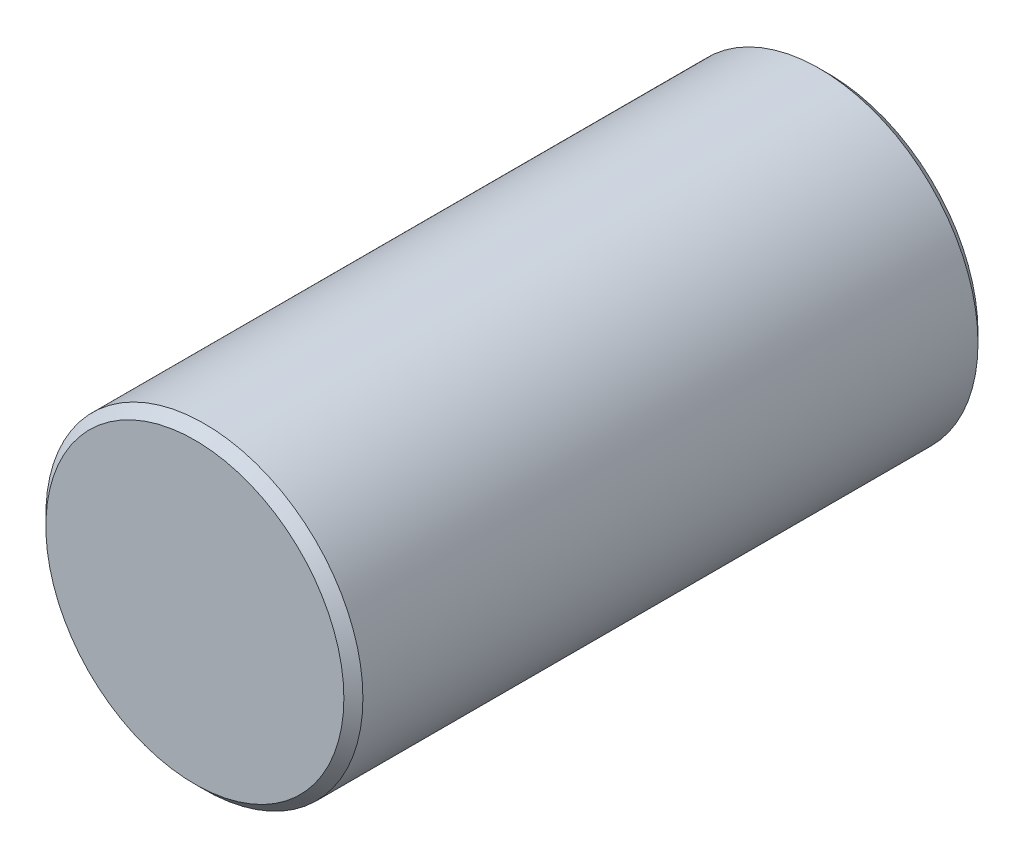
from build123d import *

# Parameters (mm, degrees)
SKETCH1_R      = 12.7
EXTRUDE1_DEPTH = 25.4
CHAMFER1_SIZE  = 0.762
CHAMFER2_SIZE  = 0.762


with BuildPart() as part:
    # Sketch1 → Extrude1 (new, symmetric)
    with BuildSketch(Plane.XY):
        Circle(SKETCH1_R)
    extrude(amount=EXTRUDE1_DEPTH, both=True)

    # Chamfer1
    chamfer1_edges = [part.edges().sort_by_distance(p)[0] for p in [
        (-12.7, 0, 25.4),
    ]]
    chamfer(chamfer1_edges, length=CHAMFER1_SIZE)

    # Chamfer2
    chamfer2_edges = [part.edges().sort_by_distance(p)[0] for p in [
        (-12.7, 0, -25.4),
    ]]
    chamfer(chamfer2_edges, length=CHAMFER2_SIZE)


solid = part.part
